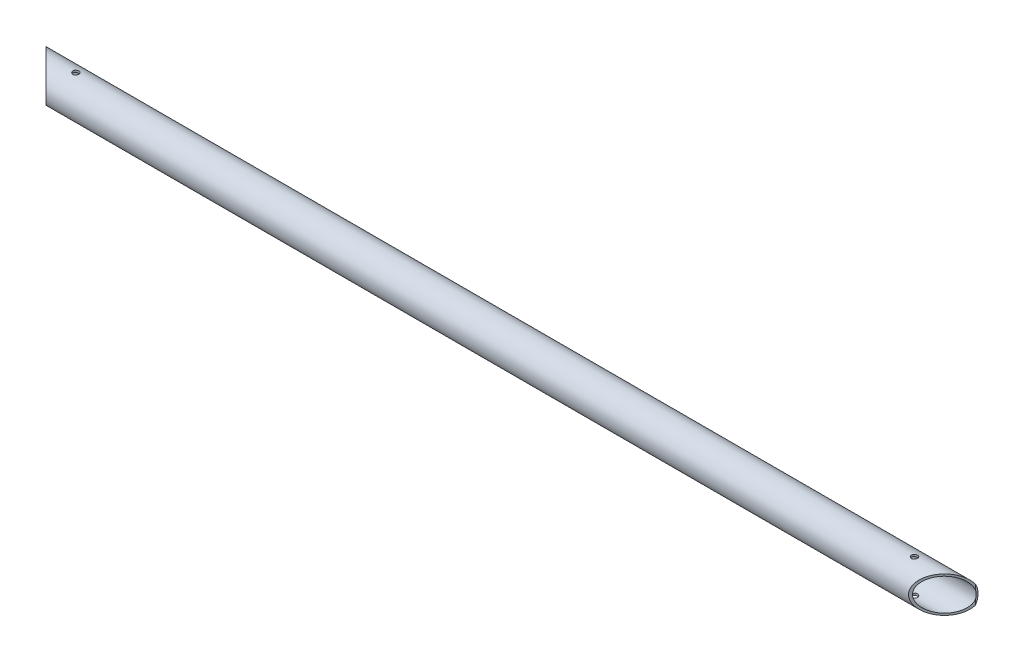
ISO-10303-21;
HEADER;
FILE_DESCRIPTION(('STEP AP214'),'2;1');
FILE_NAME('part.step','',(''),(''),'','','');
FILE_SCHEMA(('AUTOMOTIVE_DESIGN { 1 0 10303 214 1 1 1 1 }'));
ENDSEC;
DATA;
#1=APPLICATION_CONTEXT('core data for automotive mechanical design processes');
#2=APPLICATION_PROTOCOL_DEFINITION('international standard','automotive_design',2000,#1);
#3=PRODUCT_CONTEXT('',#1,'mechanical');
#4=PRODUCT('Part','Part','',(#3));
#5=PRODUCT_RELATED_PRODUCT_CATEGORY('part','',(#4));
#6=PRODUCT_DEFINITION_FORMATION('','',#4);
#7=PRODUCT_DEFINITION_CONTEXT('part definition',#1,'design');
#8=PRODUCT_DEFINITION('design','',#6,#7);
#9=PRODUCT_DEFINITION_SHAPE('','',#8);
#10=(LENGTH_UNIT() NAMED_UNIT(*) SI_UNIT(.MILLI.,.METRE.));
#11=(NAMED_UNIT(*) PLANE_ANGLE_UNIT() SI_UNIT($,.RADIAN.));
#12=(NAMED_UNIT(*) SI_UNIT($,.STERADIAN.) SOLID_ANGLE_UNIT());
#13=UNCERTAINTY_MEASURE_WITH_UNIT(LENGTH_MEASURE(1.E-05),#10,'distance_accuracy_value','');
#14=(GEOMETRIC_REPRESENTATION_CONTEXT(3) GLOBAL_UNCERTAINTY_ASSIGNED_CONTEXT((#13)) GLOBAL_UNIT_ASSIGNED_CONTEXT((#10,
#11,#12)) REPRESENTATION_CONTEXT('',''));
#15=CARTESIAN_POINT('',(0.,0.,0.));
#16=DIRECTION('',(0.,0.,1.));
#17=DIRECTION('',(1.,0.,0.));
#18=AXIS2_PLACEMENT_3D('',#15,#16,#17);
#19=CARTESIAN_POINT('',(495.3,0.,0.));
#20=DIRECTION('',(-1.,0.,0.));
#21=DIRECTION('',(0.,0.,1.));
#22=AXIS2_PLACEMENT_3D('',#19,#20,#21);
#23=CYLINDRICAL_SURFACE('',#22,19.05);
#24=CARTESIAN_POINT('',(-447.675,19.05,0.));
#25=CARTESIAN_POINT('',(-447.674992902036,19.0499969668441,-0.177026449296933));
#26=CARTESIAN_POINT('',(-447.660144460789,19.0475067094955,-0.354149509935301));
#27=CARTESIAN_POINT('',(-447.601167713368,19.0378123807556,-0.70342788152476));
#28=CARTESIAN_POINT('',(-447.557012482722,19.0306039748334,-0.875578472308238));
#29=CARTESIAN_POINT('',(-447.440792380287,19.0122818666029,-1.20980802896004));
#30=CARTESIAN_POINT('',(-447.368750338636,19.0011713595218,-1.37189510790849));
#31=CARTESIAN_POINT('',(-447.198861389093,18.9762666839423,-1.68166013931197));
#32=CARTESIAN_POINT('',(-447.101017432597,18.9624728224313,-1.8293397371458));
#33=CARTESIAN_POINT('',(-446.881307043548,18.9335831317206,-2.10753022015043));
#34=CARTESIAN_POINT('',(-446.759242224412,18.9184771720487,-2.23788338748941));
#35=CARTESIAN_POINT('',(-446.494982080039,18.8887433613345,-2.4763583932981));
#36=CARTESIAN_POINT('',(-446.35278548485,18.8741155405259,-2.58447882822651));
#37=CARTESIAN_POINT('',(-446.05121487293,18.8468960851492,-2.7760512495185));
#38=CARTESIAN_POINT('',(-445.891740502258,18.8343175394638,-2.85934728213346));
#39=CARTESIAN_POINT('',(-445.560818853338,18.8127613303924,-2.99790912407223));
#40=CARTESIAN_POINT('',(-445.389372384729,18.8037834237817,-3.0531768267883));
#41=CARTESIAN_POINT('',(-445.041045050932,18.790545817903,-3.13361625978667));
#42=CARTESIAN_POINT('',(-444.864228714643,18.7862434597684,-3.15906026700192));
#43=CARTESIAN_POINT('',(-444.508788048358,18.7827150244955,-3.1799742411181));
#44=CARTESIAN_POINT('',(-444.330163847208,18.7834885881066,-3.17544632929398));
#45=CARTESIAN_POINT('',(-443.97812161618,18.7899856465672,-3.13676677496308));
#46=CARTESIAN_POINT('',(-443.804668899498,18.7956580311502,-3.10292099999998));
#47=CARTESIAN_POINT('',(-443.465938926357,18.8112335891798,-3.00704648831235));
#48=CARTESIAN_POINT('',(-443.300661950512,18.8211369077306,-2.94501678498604));
#49=CARTESIAN_POINT('',(-442.98205939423,18.8441136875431,-2.79422510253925));
#50=CARTESIAN_POINT('',(-442.828795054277,18.857202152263,-2.70533611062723));
#51=CARTESIAN_POINT('',(-442.539241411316,18.8850640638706,-2.50343926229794));
#52=CARTESIAN_POINT('',(-442.402953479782,18.8998376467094,-2.39042945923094));
#53=CARTESIAN_POINT('',(-442.149450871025,18.9296297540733,-2.14183240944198));
#54=CARTESIAN_POINT('',(-442.032493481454,18.944649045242,-2.00598273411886));
#55=CARTESIAN_POINT('',(-441.822995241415,18.9730710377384,-1.71644976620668));
#56=CARTESIAN_POINT('',(-441.730454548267,18.9864737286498,-1.56276635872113));
#57=CARTESIAN_POINT('',(-441.572393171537,19.01017143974,-1.24168651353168));
#58=CARTESIAN_POINT('',(-441.506895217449,19.0204638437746,-1.07427868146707));
#59=CARTESIAN_POINT('',(-441.405017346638,19.0367602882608,-0.730628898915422));
#60=CARTESIAN_POINT('',(-441.368634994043,19.042764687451,-0.55438768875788));
#61=CARTESIAN_POINT('',(-441.326369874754,19.0497603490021,-0.200291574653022));
#62=CARTESIAN_POINT('',(-441.320133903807,19.0508096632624,-0.0224799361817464));
#63=CARTESIAN_POINT('',(-441.337396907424,19.0479359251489,0.331647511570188));
#64=CARTESIAN_POINT('',(-441.36089473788,19.0440130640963,0.507963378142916));
#65=CARTESIAN_POINT('',(-441.436664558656,19.0316717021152,0.853003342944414));
#66=CARTESIAN_POINT('',(-441.488761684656,19.0232805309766,1.02176690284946));
#67=CARTESIAN_POINT('',(-441.620064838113,19.0029396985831,1.34816454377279));
#68=CARTESIAN_POINT('',(-441.699272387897,18.9909898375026,1.50579799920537));
#69=CARTESIAN_POINT('',(-441.883356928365,18.9647133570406,1.8069949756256));
#70=CARTESIAN_POINT('',(-441.988454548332,18.9503666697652,1.95042186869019));
#71=CARTESIAN_POINT('',(-442.221032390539,18.9209485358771,2.21772935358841));
#72=CARTESIAN_POINT('',(-442.348514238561,18.9058770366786,2.34160852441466));
#73=CARTESIAN_POINT('',(-442.623825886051,18.8765202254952,2.56761333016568));
#74=CARTESIAN_POINT('',(-442.771852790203,18.8622446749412,2.66950032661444));
#75=CARTESIAN_POINT('',(-443.083128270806,18.8362784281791,2.84696193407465));
#76=CARTESIAN_POINT('',(-443.246376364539,18.8245876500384,2.92253737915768));
#77=CARTESIAN_POINT('',(-443.582792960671,18.8051878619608,3.04487368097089));
#78=CARTESIAN_POINT('',(-443.755917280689,18.7974624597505,3.09175331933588));
#79=CARTESIAN_POINT('',(-444.107722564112,18.7868270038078,3.15574102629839));
#80=CARTESIAN_POINT('',(-444.28640304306,18.7839165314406,3.17285168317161));
#81=CARTESIAN_POINT('',(-444.641865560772,18.783258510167,3.17674353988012));
#82=CARTESIAN_POINT('',(-444.818643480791,18.7854470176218,3.16390037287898));
#83=CARTESIAN_POINT('',(-445.167485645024,18.7946002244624,3.10906139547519));
#84=CARTESIAN_POINT('',(-445.339549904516,18.8015649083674,3.06706567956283));
#85=CARTESIAN_POINT('',(-445.673935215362,18.8194614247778,2.95525760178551));
#86=CARTESIAN_POINT('',(-445.836267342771,18.8303886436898,2.88547758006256));
#87=CARTESIAN_POINT('',(-446.146981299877,18.854983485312,2.72012029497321));
#88=CARTESIAN_POINT('',(-446.295362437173,18.8686512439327,2.62454175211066));
#89=CARTESIAN_POINT('',(-446.575860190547,18.8973898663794,2.40895998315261));
#90=CARTESIAN_POINT('',(-446.707762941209,18.912475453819,2.28868041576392));
#91=CARTESIAN_POINT('',(-446.949641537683,18.9422325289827,2.02769346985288));
#92=CARTESIAN_POINT('',(-447.059612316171,18.9569039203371,1.88698138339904));
#93=CARTESIAN_POINT('',(-447.255199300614,18.9842969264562,1.58796884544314));
#94=CARTESIAN_POINT('',(-447.340642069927,18.9970043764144,1.42955364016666));
#95=CARTESIAN_POINT('',(-447.483572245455,19.0188998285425,1.10047159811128));
#96=CARTESIAN_POINT('',(-447.541087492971,19.028091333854,0.92981715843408));
#97=CARTESIAN_POINT('',(-447.614046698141,19.0399135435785,0.63208320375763));
#98=CARTESIAN_POINT('',(-447.636867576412,19.0436757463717,0.506804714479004));
#99=CARTESIAN_POINT('',(-447.667346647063,19.0487200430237,0.254367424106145));
#100=CARTESIAN_POINT('',(-447.675005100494,19.0500021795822,0.127208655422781));
#101=CARTESIAN_POINT('',(-447.675,19.05,0.));
#102=B_SPLINE_CURVE_WITH_KNOTS('',3,(#24,#25,#26,#27,#28,#29,#30,#31,#32,#33,#34,#35,#36,#37,
#38,#39,#40,#41,#42,#43,#44,#45,#46,#47,#48,#49,#50,#51,#52,#53,#54,#55,#56,#57,#58,#59,#60,#61,
#62,#63,#64,#65,#66,#67,#68,#69,#70,#71,#72,#73,#74,#75,#76,#77,#78,#79,#80,#81,#82,#83,#84,#85,
#86,#87,#88,#89,#90,#91,#92,#93,#94,#95,#96,#97,#98,#99,#100,#101),.UNSPECIFIED.,.T.,.F.,(4,2,2,
2,2,2,2,2,2,2,2,2,2,2,2,2,2,2,2,2,2,2,2,2,2,2,2,2,2,2,2,2,2,2,2,2,2,2,4),(0.,0.530614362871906,
1.06171688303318,1.59238552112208,2.12299348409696,2.65814163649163,3.19332356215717,
3.73180001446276,4.27024008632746,4.80372517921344,5.33717251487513,5.86512062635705,
6.39308684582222,6.92358986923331,7.45413572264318,7.9912561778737,8.52838009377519,
9.0659545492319,9.60348402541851,10.1347001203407,10.6658957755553,11.1938791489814,
11.7218921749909,12.2545706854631,12.7872879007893,13.3255235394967,13.8637421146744,
14.3997174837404,14.9356462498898,15.4648904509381,15.9941329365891,16.5227611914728,
17.0514156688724,17.5863425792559,18.1213929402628,18.6601383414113,19.1983455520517,
19.5796439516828,19.9609357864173),.UNSPECIFIED.);
#103=CARTESIAN_POINT('',(-447.675,19.05,0.));
#104=VERTEX_POINT('',#103);
#105=EDGE_CURVE('E164',#104,#104,#102,.T.);
#106=ORIENTED_EDGE('',*,*,#105,.T.);
#107=EDGE_LOOP('',(#106));
#108=FACE_BOUND('',#107,.T.);
#109=CARTESIAN_POINT('',(-444.5,-18.7835533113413,-3.17499999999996));
#110=CARTESIAN_POINT('',(-444.677007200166,-18.7835565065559,-3.17499288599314));
#111=CARTESIAN_POINT('',(-444.854111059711,-18.7860824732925,-3.16014756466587));
#112=CARTESIAN_POINT('',(-445.203349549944,-18.7959042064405,-3.10118433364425));
#113=CARTESIAN_POINT('',(-445.375479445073,-18.8032043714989,-3.05703942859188));
#114=CARTESIAN_POINT('',(-445.709665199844,-18.8217252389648,-2.94084952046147));
#115=CARTESIAN_POINT('',(-445.871729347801,-18.8329426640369,-2.86882783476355));
#116=CARTESIAN_POINT('',(-446.181455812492,-18.858030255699,-2.69898685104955));
#117=CARTESIAN_POINT('',(-446.329119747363,-18.8719001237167,-2.60117045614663));
#118=CARTESIAN_POINT('',(-446.607327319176,-18.9008825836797,-2.38148815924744));
#119=CARTESIAN_POINT('',(-446.737708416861,-18.9160050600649,-2.25941769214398));
#120=CARTESIAN_POINT('',(-446.976237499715,-18.945701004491,-1.9951344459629));
#121=CARTESIAN_POINT('',(-447.084384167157,-18.960274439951,-1.85292047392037));
#122=CARTESIAN_POINT('',(-447.275984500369,-18.9873348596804,-1.55133404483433));
#123=CARTESIAN_POINT('',(-447.359286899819,-18.9998088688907,-1.39186422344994));
#124=CARTESIAN_POINT('',(-447.497861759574,-19.0211549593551,-1.06095243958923));
#125=CARTESIAN_POINT('',(-447.553136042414,-19.0300272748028,-0.889511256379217));
#126=CARTESIAN_POINT('',(-447.63358851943,-19.0431005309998,-0.54120253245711));
#127=CARTESIAN_POINT('',(-447.659039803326,-19.0473438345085,-0.364399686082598));
#128=CARTESIAN_POINT('',(-447.679973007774,-19.0508265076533,-0.00898561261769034));
#129=CARTESIAN_POINT('',(-447.675456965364,-19.0500662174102,0.169625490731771));
#130=CARTESIAN_POINT('',(-447.636796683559,-19.0436609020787,0.521718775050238));
#131=CARTESIAN_POINT('',(-447.60294634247,-19.0380643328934,0.695234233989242));
#132=CARTESIAN_POINT('',(-447.507041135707,-19.0226693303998,1.03408731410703));
#133=CARTESIAN_POINT('',(-447.444985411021,-19.0128707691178,1.19942468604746));
#134=CARTESIAN_POINT('',(-447.2941388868,-18.9900902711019,1.518102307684));
#135=CARTESIAN_POINT('',(-447.205226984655,-18.9770939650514,1.67138416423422));
#136=CARTESIAN_POINT('',(-447.003280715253,-18.949361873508,1.96096322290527));
#137=CARTESIAN_POINT('',(-446.890244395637,-18.934625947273,2.09725904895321));
#138=CARTESIAN_POINT('',(-446.641627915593,-18.904842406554,2.35073351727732));
#139=CARTESIAN_POINT('',(-446.505790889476,-18.8897931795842,2.46766016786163));
#140=CARTESIAN_POINT('',(-446.216294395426,-18.861252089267,2.67710232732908));
#141=CARTESIAN_POINT('',(-446.062634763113,-18.8477602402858,2.76961761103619));
#142=CARTESIAN_POINT('',(-445.741562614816,-18.8238606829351,2.92766043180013));
#143=CARTESIAN_POINT('',(-445.574134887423,-18.813456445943,2.99315762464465));
#144=CARTESIAN_POINT('',(-445.230441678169,-18.7969675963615,3.09502793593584));
#145=CARTESIAN_POINT('',(-445.054176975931,-18.7908826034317,3.1314036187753));
#146=CARTESIAN_POINT('',(-444.700067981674,-18.7837947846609,3.17364349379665));
#147=CARTESIAN_POINT('',(-444.522267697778,-18.7827321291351,3.17986690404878));
#148=CARTESIAN_POINT('',(-444.168165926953,-18.785649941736,3.16258283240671));
#149=CARTESIAN_POINT('',(-443.991864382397,-18.7896302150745,3.13907649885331));
#150=CARTESIAN_POINT('',(-443.646905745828,-18.8021301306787,3.06330646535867));
#151=CARTESIAN_POINT('',(-443.478207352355,-18.810620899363,3.01122561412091));
#152=CARTESIAN_POINT('',(-443.151932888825,-18.8311608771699,2.87997670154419));
#153=CARTESIAN_POINT('',(-442.99435748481,-18.8432102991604,2.80080701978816));
#154=CARTESIAN_POINT('',(-442.693203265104,-18.8696489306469,2.61677997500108));
#155=CARTESIAN_POINT('',(-442.5497669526,-18.8840586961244,2.51169241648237));
#156=CARTESIAN_POINT('',(-442.282435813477,-18.9135342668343,2.27912862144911));
#157=CARTESIAN_POINT('',(-442.158542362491,-18.9286001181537,2.1516508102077));
#158=CARTESIAN_POINT('',(-441.932502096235,-18.957879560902,1.87633364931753));
#159=CARTESIAN_POINT('',(-441.830594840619,-18.9720826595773,1.7282963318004));
#160=CARTESIAN_POINT('',(-441.653097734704,-18.9978679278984,1.41699417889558));
#161=CARTESIAN_POINT('',(-441.577507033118,-19.0094501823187,1.25372983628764));
#162=CARTESIAN_POINT('',(-441.455161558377,-19.0286431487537,0.917319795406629));
#163=CARTESIAN_POINT('',(-441.408281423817,-19.0362711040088,0.744220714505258));
#164=CARTESIAN_POINT('',(-441.344284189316,-19.0467689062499,0.392469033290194));
#165=CARTESIAN_POINT('',(-441.32716464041,-19.0496391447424,0.213816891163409));
#166=CARTESIAN_POINT('',(-441.323245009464,-19.0502925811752,-0.141657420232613));
#167=CARTESIAN_POINT('',(-441.336080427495,-19.0481369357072,-0.318475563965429));
#168=CARTESIAN_POINT('',(-441.390917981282,-19.0391056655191,-0.667400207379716));
#169=CARTESIAN_POINT('',(-441.432919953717,-19.0322300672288,-0.839506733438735));
#170=CARTESIAN_POINT('',(-441.54475847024,-19.014528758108,-1.17398348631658));
#171=CARTESIAN_POINT('',(-441.614564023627,-19.0037074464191,-1.33636432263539));
#172=CARTESIAN_POINT('',(-441.779987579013,-18.979296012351,-1.64716517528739));
#173=CARTESIAN_POINT('',(-441.875606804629,-18.9657057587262,-1.79558452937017));
#174=CARTESIAN_POINT('',(-442.091235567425,-18.9370668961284,-2.07608544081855));
#175=CARTESIAN_POINT('',(-442.211512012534,-18.9220033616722,-2.20796031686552));
#176=CARTESIAN_POINT('',(-442.472480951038,-18.8922190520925,-2.44978412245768));
#177=CARTESIAN_POINT('',(-442.613178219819,-18.8774983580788,-2.55972790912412));
#178=CARTESIAN_POINT('',(-442.912176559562,-18.8499539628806,-2.75528312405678));
#179=CARTESIAN_POINT('',(-443.070595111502,-18.8371444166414,-2.84071693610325));
#180=CARTESIAN_POINT('',(-443.399683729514,-18.8150399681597,-2.98362946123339));
#181=CARTESIAN_POINT('',(-443.5703413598,-18.805741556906,-3.04113610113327));
#182=CARTESIAN_POINT('',(-443.868052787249,-18.7937742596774,-3.11407308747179));
#183=CARTESIAN_POINT('',(-443.993304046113,-18.7899627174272,-3.13688402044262));
#184=CARTESIAN_POINT('',(-444.245686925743,-18.7848511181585,-3.16734989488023));
#185=CARTESIAN_POINT('',(-444.372818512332,-18.7835510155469,-3.17500511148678));
#186=CARTESIAN_POINT('',(-444.5,-18.7835533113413,-3.17499999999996));
#187=B_SPLINE_CURVE_WITH_KNOTS('',3,(#109,#110,#111,#112,#113,#114,#115,#116,#117,#118,#119,
#120,#121,#122,#123,#124,#125,#126,#127,#128,#129,#130,#131,#132,#133,#134,#135,#136,#137,#138,
#139,#140,#141,#142,#143,#144,#145,#146,#147,#148,#149,#150,#151,#152,#153,#154,#155,#156,#157,
#158,#159,#160,#161,#162,#163,#164,#165,#166,#167,#168,#169,#170,#171,#172,#173,#174,#175,#176,
#177,#178,#179,#180,#181,#182,#183,#184,#185,#186),.UNSPECIFIED.,.T.,.F.,(4,2,2,2,2,2,2,2,2,2,2,
2,2,2,2,2,2,2,2,2,2,2,2,2,2,2,2,2,2,2,2,2,2,2,2,2,2,2,4),(0.,0.530556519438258,1.061602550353,
1.59220534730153,2.12274845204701,2.65797232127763,3.19322790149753,3.73167884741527,
4.27009477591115,4.80354090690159,5.3369507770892,5.86507743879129,6.39322018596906,
6.92378097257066,7.45438471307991,7.99142576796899,8.52847177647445,9.06611931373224,
9.60371950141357,10.1348989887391,10.6660579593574,11.1938570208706,11.7216876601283,
12.2543867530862,12.7871233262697,13.3254002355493,13.863659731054,14.399551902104,
14.9353999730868,15.4647617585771,15.994120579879,16.5228910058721,17.0516865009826,
17.5865408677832,18.121520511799,18.6602843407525,19.1985082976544,19.5797255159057,
19.9609358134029),.UNSPECIFIED.);
#188=CARTESIAN_POINT('',(-444.5,-18.7835533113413,-3.17499999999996));
#189=VERTEX_POINT('',#188);
#190=EDGE_CURVE('E160',#189,#189,#187,.T.);
#191=ORIENTED_EDGE('',*,*,#190,.T.);
#192=EDGE_LOOP('',(#191));
#193=FACE_BOUND('',#192,.T.);
#194=CARTESIAN_POINT('',(476.25,0.,0.));
#195=DIRECTION('',(-0.707106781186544,0.,-0.707106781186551));
#196=DIRECTION('',(-0.707106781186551,0.,0.707106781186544));
#197=AXIS2_PLACEMENT_3D('',#194,#195,#196);
#198=ELLIPSE('',#197,26.9407683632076,19.05);
#199=CARTESIAN_POINT('',(492.76,-9.50380976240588,-16.5100000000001));
#200=VERTEX_POINT('',#199);
#201=CARTESIAN_POINT('',(492.76,9.50380976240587,-16.51));
#202=VERTEX_POINT('',#201);
#203=EDGE_CURVE('E78',#200,#202,#198,.T.);
#204=ORIENTED_EDGE('',*,*,#203,.T.);
#205=CARTESIAN_POINT('',(492.76,0.,0.));
#206=DIRECTION('',(-1.,0.,0.));
#207=DIRECTION('',(0.,0.,1.));
#208=AXIS2_PLACEMENT_3D('',#205,#206,#207);
#209=CIRCLE('',#208,19.05);
#210=EDGE_CURVE('E51',#202,#200,#209,.T.);
#211=ORIENTED_EDGE('',*,*,#210,.T.);
#212=EDGE_LOOP('',(#204,#211));
#213=FACE_BOUND('',#212,.T.);
#214=CARTESIAN_POINT('',(-492.76,0.,0.));
#215=DIRECTION('',(-1.,0.,0.));
#216=DIRECTION('',(0.,0.,1.));
#217=AXIS2_PLACEMENT_3D('',#214,#215,#216);
#218=CIRCLE('',#217,19.05);
#219=CARTESIAN_POINT('',(-492.76,9.50380976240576,-16.5100000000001));
#220=VERTEX_POINT('',#219);
#221=CARTESIAN_POINT('',(-492.76,-9.50380976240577,-16.51));
#222=VERTEX_POINT('',#221);
#223=EDGE_CURVE('E59',#220,#222,#218,.T.);
#224=ORIENTED_EDGE('',*,*,#223,.F.);
#225=CARTESIAN_POINT('',(-476.25,0.,0.));
#226=DIRECTION('',(-0.707106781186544,0.,0.707106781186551));
#227=DIRECTION('',(-0.707106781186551,0.,-0.707106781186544));
#228=AXIS2_PLACEMENT_3D('',#225,#226,#227);
#229=ELLIPSE('',#228,26.9407683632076,19.05);
#230=EDGE_CURVE('E92',#222,#220,#229,.T.);
#231=ORIENTED_EDGE('',*,*,#230,.F.);
#232=EDGE_LOOP('',(#224,#231));
#233=FACE_BOUND('',#232,.T.);
#234=CARTESIAN_POINT('',(444.5,-18.7835533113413,-3.17499999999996));
#235=CARTESIAN_POINT('',(444.677007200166,-18.7835565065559,-3.17499288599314));
#236=CARTESIAN_POINT('',(444.854111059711,-18.7860824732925,-3.16014756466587));
#237=CARTESIAN_POINT('',(445.203349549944,-18.7959042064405,-3.10118433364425));
#238=CARTESIAN_POINT('',(445.375479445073,-18.8032043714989,-3.05703942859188));
#239=CARTESIAN_POINT('',(445.709665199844,-18.8217252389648,-2.94084952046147));
#240=CARTESIAN_POINT('',(445.871729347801,-18.8329426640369,-2.86882783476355));
#241=CARTESIAN_POINT('',(446.181455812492,-18.858030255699,-2.69898685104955));
#242=CARTESIAN_POINT('',(446.329119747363,-18.8719001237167,-2.60117045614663));
#243=CARTESIAN_POINT('',(446.607327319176,-18.9008825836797,-2.38148815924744));
#244=CARTESIAN_POINT('',(446.737708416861,-18.9160050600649,-2.25941769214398));
#245=CARTESIAN_POINT('',(446.976237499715,-18.945701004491,-1.9951344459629));
#246=CARTESIAN_POINT('',(447.084384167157,-18.960274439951,-1.85292047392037));
#247=CARTESIAN_POINT('',(447.275984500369,-18.9873348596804,-1.55133404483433));
#248=CARTESIAN_POINT('',(447.359286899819,-18.9998088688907,-1.39186422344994));
#249=CARTESIAN_POINT('',(447.497861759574,-19.0211549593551,-1.06095243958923));
#250=CARTESIAN_POINT('',(447.553136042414,-19.0300272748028,-0.889511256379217));
#251=CARTESIAN_POINT('',(447.63358851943,-19.0431005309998,-0.54120253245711));
#252=CARTESIAN_POINT('',(447.659039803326,-19.0473438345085,-0.364399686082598));
#253=CARTESIAN_POINT('',(447.679973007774,-19.0508265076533,-0.00898561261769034));
#254=CARTESIAN_POINT('',(447.675456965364,-19.0500662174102,0.169625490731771));
#255=CARTESIAN_POINT('',(447.636796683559,-19.0436609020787,0.521718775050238));
#256=CARTESIAN_POINT('',(447.60294634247,-19.0380643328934,0.695234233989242));
#257=CARTESIAN_POINT('',(447.507041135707,-19.0226693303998,1.03408731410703));
#258=CARTESIAN_POINT('',(447.444985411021,-19.0128707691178,1.19942468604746));
#259=CARTESIAN_POINT('',(447.2941388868,-18.9900902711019,1.518102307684));
#260=CARTESIAN_POINT('',(447.205226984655,-18.9770939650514,1.67138416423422));
#261=CARTESIAN_POINT('',(447.003280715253,-18.949361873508,1.96096322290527));
#262=CARTESIAN_POINT('',(446.890244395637,-18.934625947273,2.09725904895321));
#263=CARTESIAN_POINT('',(446.641627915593,-18.904842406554,2.35073351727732));
#264=CARTESIAN_POINT('',(446.505790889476,-18.8897931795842,2.46766016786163));
#265=CARTESIAN_POINT('',(446.216294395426,-18.861252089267,2.67710232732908));
#266=CARTESIAN_POINT('',(446.062634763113,-18.8477602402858,2.76961761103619));
#267=CARTESIAN_POINT('',(445.741562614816,-18.8238606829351,2.92766043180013));
#268=CARTESIAN_POINT('',(445.574134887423,-18.813456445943,2.99315762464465));
#269=CARTESIAN_POINT('',(445.230441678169,-18.7969675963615,3.09502793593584));
#270=CARTESIAN_POINT('',(445.054176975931,-18.7908826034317,3.1314036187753));
#271=CARTESIAN_POINT('',(444.700067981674,-18.7837947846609,3.17364349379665));
#272=CARTESIAN_POINT('',(444.522267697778,-18.7827321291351,3.17986690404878));
#273=CARTESIAN_POINT('',(444.168165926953,-18.785649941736,3.16258283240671));
#274=CARTESIAN_POINT('',(443.991864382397,-18.7896302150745,3.13907649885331));
#275=CARTESIAN_POINT('',(443.646905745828,-18.8021301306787,3.06330646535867));
#276=CARTESIAN_POINT('',(443.478207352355,-18.810620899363,3.01122561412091));
#277=CARTESIAN_POINT('',(443.151932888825,-18.8311608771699,2.87997670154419));
#278=CARTESIAN_POINT('',(442.99435748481,-18.8432102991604,2.80080701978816));
#279=CARTESIAN_POINT('',(442.693203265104,-18.8696489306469,2.61677997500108));
#280=CARTESIAN_POINT('',(442.5497669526,-18.8840586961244,2.51169241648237));
#281=CARTESIAN_POINT('',(442.282435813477,-18.9135342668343,2.27912862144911));
#282=CARTESIAN_POINT('',(442.158542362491,-18.9286001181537,2.1516508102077));
#283=CARTESIAN_POINT('',(441.932502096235,-18.957879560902,1.87633364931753));
#284=CARTESIAN_POINT('',(441.830594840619,-18.9720826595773,1.7282963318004));
#285=CARTESIAN_POINT('',(441.653097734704,-18.9978679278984,1.41699417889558));
#286=CARTESIAN_POINT('',(441.577507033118,-19.0094501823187,1.25372983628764));
#287=CARTESIAN_POINT('',(441.455161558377,-19.0286431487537,0.917319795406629));
#288=CARTESIAN_POINT('',(441.408281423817,-19.0362711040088,0.744220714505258));
#289=CARTESIAN_POINT('',(441.344284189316,-19.0467689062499,0.392469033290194));
#290=CARTESIAN_POINT('',(441.32716464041,-19.0496391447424,0.213816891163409));
#291=CARTESIAN_POINT('',(441.323245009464,-19.0502925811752,-0.141657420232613));
#292=CARTESIAN_POINT('',(441.336080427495,-19.0481369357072,-0.318475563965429));
#293=CARTESIAN_POINT('',(441.390917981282,-19.0391056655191,-0.667400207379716));
#294=CARTESIAN_POINT('',(441.432919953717,-19.0322300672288,-0.839506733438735));
#295=CARTESIAN_POINT('',(441.54475847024,-19.014528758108,-1.17398348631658));
#296=CARTESIAN_POINT('',(441.614564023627,-19.0037074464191,-1.33636432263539));
#297=CARTESIAN_POINT('',(441.779987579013,-18.979296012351,-1.64716517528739));
#298=CARTESIAN_POINT('',(441.875606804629,-18.9657057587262,-1.79558452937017));
#299=CARTESIAN_POINT('',(442.091235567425,-18.9370668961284,-2.07608544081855));
#300=CARTESIAN_POINT('',(442.211512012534,-18.9220033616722,-2.20796031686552));
#301=CARTESIAN_POINT('',(442.472480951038,-18.8922190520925,-2.44978412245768));
#302=CARTESIAN_POINT('',(442.613178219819,-18.8774983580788,-2.55972790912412));
#303=CARTESIAN_POINT('',(442.912176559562,-18.8499539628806,-2.75528312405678));
#304=CARTESIAN_POINT('',(443.070595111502,-18.8371444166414,-2.84071693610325));
#305=CARTESIAN_POINT('',(443.399683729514,-18.8150399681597,-2.98362946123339));
#306=CARTESIAN_POINT('',(443.5703413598,-18.805741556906,-3.04113610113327));
#307=CARTESIAN_POINT('',(443.868052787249,-18.7937742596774,-3.11407308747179));
#308=CARTESIAN_POINT('',(443.993304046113,-18.7899627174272,-3.13688402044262));
#309=CARTESIAN_POINT('',(444.245686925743,-18.7848511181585,-3.16734989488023));
#310=CARTESIAN_POINT('',(444.372818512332,-18.7835510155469,-3.17500511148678));
#311=CARTESIAN_POINT('',(444.5,-18.7835533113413,-3.17499999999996));
#312=B_SPLINE_CURVE_WITH_KNOTS('',3,(#234,#235,#236,#237,#238,#239,#240,#241,#242,#243,#244,
#245,#246,#247,#248,#249,#250,#251,#252,#253,#254,#255,#256,#257,#258,#259,#260,#261,#262,#263,
#264,#265,#266,#267,#268,#269,#270,#271,#272,#273,#274,#275,#276,#277,#278,#279,#280,#281,#282,
#283,#284,#285,#286,#287,#288,#289,#290,#291,#292,#293,#294,#295,#296,#297,#298,#299,#300,#301,
#302,#303,#304,#305,#306,#307,#308,#309,#310,#311),.UNSPECIFIED.,.T.,.F.,(4,2,2,2,2,2,2,2,2,2,2,
2,2,2,2,2,2,2,2,2,2,2,2,2,2,2,2,2,2,2,2,2,2,2,2,2,2,2,4),(0.,0.530556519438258,1.061602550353,
1.59220534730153,2.12274845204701,2.65797232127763,3.19322790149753,3.73167884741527,
4.27009477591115,4.80354090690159,5.3369507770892,5.86507743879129,6.39322018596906,
6.92378097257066,7.45438471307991,7.99142576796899,8.52847177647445,9.06611931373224,
9.60371950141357,10.1348989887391,10.6660579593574,11.1938570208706,11.7216876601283,
12.2543867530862,12.7871233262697,13.3254002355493,13.863659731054,14.399551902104,
14.9353999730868,15.4647617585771,15.994120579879,16.5228910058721,17.0516865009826,
17.5865408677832,18.121520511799,18.6602843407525,19.1985082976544,19.5797255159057,
19.9609358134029),.UNSPECIFIED.);
#313=CARTESIAN_POINT('',(444.5,-18.7835533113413,-3.17499999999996));
#314=VERTEX_POINT('',#313);
#315=EDGE_CURVE('E127',#314,#314,#312,.T.);
#316=ORIENTED_EDGE('',*,*,#315,.F.);
#317=EDGE_LOOP('',(#316));
#318=FACE_BOUND('',#317,.T.);
#319=CARTESIAN_POINT('',(441.325,19.05,0.));
#320=CARTESIAN_POINT('',(441.325007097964,19.0499969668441,0.177026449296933));
#321=CARTESIAN_POINT('',(441.339855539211,19.0475067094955,0.354149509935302));
#322=CARTESIAN_POINT('',(441.398832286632,19.0378123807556,0.703427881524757));
#323=CARTESIAN_POINT('',(441.442987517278,19.0306039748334,0.875578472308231));
#324=CARTESIAN_POINT('',(441.559207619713,19.0122818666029,1.20980802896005));
#325=CARTESIAN_POINT('',(441.631249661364,19.0011713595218,1.37189510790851));
#326=CARTESIAN_POINT('',(441.801138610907,18.9762666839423,1.68166013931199));
#327=CARTESIAN_POINT('',(441.898982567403,18.9624728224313,1.82933973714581));
#328=CARTESIAN_POINT('',(442.118692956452,18.9335831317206,2.10753022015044));
#329=CARTESIAN_POINT('',(442.240757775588,18.9184771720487,2.23788338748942));
#330=CARTESIAN_POINT('',(442.505017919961,18.8887433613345,2.47635839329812));
#331=CARTESIAN_POINT('',(442.64721451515,18.8741155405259,2.58447882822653));
#332=CARTESIAN_POINT('',(442.94878512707,18.8468960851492,2.77605124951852));
#333=CARTESIAN_POINT('',(443.108259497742,18.8343175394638,2.85934728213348));
#334=CARTESIAN_POINT('',(443.439181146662,18.8127613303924,2.99790912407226));
#335=CARTESIAN_POINT('',(443.610627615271,18.8037834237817,3.05317682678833));
#336=CARTESIAN_POINT('',(443.958954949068,18.790545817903,3.13361625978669));
#337=CARTESIAN_POINT('',(444.135771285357,18.7862434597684,3.15906026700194));
#338=CARTESIAN_POINT('',(444.491211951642,18.7827150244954,3.17997424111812));
#339=CARTESIAN_POINT('',(444.669836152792,18.7834885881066,3.17544632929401));
#340=CARTESIAN_POINT('',(445.02187838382,18.7899856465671,3.1367667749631));
#341=CARTESIAN_POINT('',(445.195331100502,18.7956580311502,3.102921));
#342=CARTESIAN_POINT('',(445.534061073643,18.8112335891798,3.00704648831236));
#343=CARTESIAN_POINT('',(445.699338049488,18.8211369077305,2.94501678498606));
#344=CARTESIAN_POINT('',(446.01794060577,18.8441136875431,2.79422510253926));
#345=CARTESIAN_POINT('',(446.171204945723,18.857202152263,2.70533611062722));
#346=CARTESIAN_POINT('',(446.460758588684,18.8850640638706,2.50343926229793));
#347=CARTESIAN_POINT('',(446.597046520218,18.8998376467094,2.39042945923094));
#348=CARTESIAN_POINT('',(446.850549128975,18.9296297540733,2.14183240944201));
#349=CARTESIAN_POINT('',(446.967506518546,18.944649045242,2.0059827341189));
#350=CARTESIAN_POINT('',(447.177004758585,18.9730710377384,1.71644976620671));
#351=CARTESIAN_POINT('',(447.269545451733,18.9864737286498,1.56276635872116));
#352=CARTESIAN_POINT('',(447.427606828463,19.01017143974,1.24168651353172));
#353=CARTESIAN_POINT('',(447.493104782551,19.0204638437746,1.07427868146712));
#354=CARTESIAN_POINT('',(447.594982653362,19.0367602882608,0.73062889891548));
#355=CARTESIAN_POINT('',(447.631365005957,19.042764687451,0.554387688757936));
#356=CARTESIAN_POINT('',(447.673630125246,19.0497603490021,0.200291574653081));
#357=CARTESIAN_POINT('',(447.679866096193,19.0508096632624,0.0224799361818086));
#358=CARTESIAN_POINT('',(447.662603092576,19.0479359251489,-0.331647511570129));
#359=CARTESIAN_POINT('',(447.63910526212,19.0440130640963,-0.507963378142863));
#360=CARTESIAN_POINT('',(447.563335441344,19.0316717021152,-0.853003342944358));
#361=CARTESIAN_POINT('',(447.511238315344,19.0232805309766,-1.02176690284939));
#362=CARTESIAN_POINT('',(447.379935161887,19.0029396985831,-1.34816454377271));
#363=CARTESIAN_POINT('',(447.300727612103,18.9909898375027,-1.5057979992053));
#364=CARTESIAN_POINT('',(447.116643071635,18.9647133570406,-1.80699497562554));
#365=CARTESIAN_POINT('',(447.011545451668,18.9503666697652,-1.95042186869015));
#366=CARTESIAN_POINT('',(446.778967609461,18.9209485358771,-2.21772935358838));
#367=CARTESIAN_POINT('',(446.651485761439,18.9058770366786,-2.34160852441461));
#368=CARTESIAN_POINT('',(446.376174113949,18.8765202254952,-2.56761333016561));
#369=CARTESIAN_POINT('',(446.228147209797,18.8622446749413,-2.66950032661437));
#370=CARTESIAN_POINT('',(445.916871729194,18.8362784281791,-2.84696193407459));
#371=CARTESIAN_POINT('',(445.753623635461,18.8245876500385,-2.92253737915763));
#372=CARTESIAN_POINT('',(445.417207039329,18.8051878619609,-3.04487368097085));
#373=CARTESIAN_POINT('',(445.244082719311,18.7974624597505,-3.09175331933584));
#374=CARTESIAN_POINT('',(444.892277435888,18.7868270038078,-3.15574102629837));
#375=CARTESIAN_POINT('',(444.71359695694,18.7839165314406,-3.17285168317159));
#376=CARTESIAN_POINT('',(444.358134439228,18.783258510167,-3.1767435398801));
#377=CARTESIAN_POINT('',(444.181356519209,18.7854470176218,-3.16390037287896));
#378=CARTESIAN_POINT('',(443.832514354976,18.7946002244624,-3.10906139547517));
#379=CARTESIAN_POINT('',(443.660450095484,18.8015649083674,-3.06706567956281));
#380=CARTESIAN_POINT('',(443.326064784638,18.8194614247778,-2.95525760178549));
#381=CARTESIAN_POINT('',(443.163732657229,18.8303886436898,-2.88547758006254));
#382=CARTESIAN_POINT('',(442.853018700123,18.854983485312,-2.72012029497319));
#383=CARTESIAN_POINT('',(442.704637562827,18.8686512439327,-2.62454175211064));
#384=CARTESIAN_POINT('',(442.424139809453,18.8973898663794,-2.40895998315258));
#385=CARTESIAN_POINT('',(442.292237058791,18.9124754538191,-2.28868041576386));
#386=CARTESIAN_POINT('',(442.050358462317,18.9422325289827,-2.02769346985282));
#387=CARTESIAN_POINT('',(441.94038768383,18.9569039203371,-1.886981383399));
#388=CARTESIAN_POINT('',(441.744800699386,18.9842969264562,-1.58796884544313));
#389=CARTESIAN_POINT('',(441.659357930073,18.9970043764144,-1.42955364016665));
#390=CARTESIAN_POINT('',(441.516427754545,19.0188998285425,-1.10047159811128));
#391=CARTESIAN_POINT('',(441.458912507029,19.028091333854,-0.929817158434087));
#392=CARTESIAN_POINT('',(441.385953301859,19.0399135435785,-0.632083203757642));
#393=CARTESIAN_POINT('',(441.363132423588,19.0436757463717,-0.506804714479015));
#394=CARTESIAN_POINT('',(441.332653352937,19.0487200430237,-0.25436742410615));
#395=CARTESIAN_POINT('',(441.324994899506,19.0500021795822,-0.127208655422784));
#396=CARTESIAN_POINT('',(441.325,19.05,0.));
#397=B_SPLINE_CURVE_WITH_KNOTS('',3,(#319,#320,#321,#322,#323,#324,#325,#326,#327,#328,#329,
#330,#331,#332,#333,#334,#335,#336,#337,#338,#339,#340,#341,#342,#343,#344,#345,#346,#347,#348,
#349,#350,#351,#352,#353,#354,#355,#356,#357,#358,#359,#360,#361,#362,#363,#364,#365,#366,#367,
#368,#369,#370,#371,#372,#373,#374,#375,#376,#377,#378,#379,#380,#381,#382,#383,#384,#385,#386,
#387,#388,#389,#390,#391,#392,#393,#394,#395,#396),.UNSPECIFIED.,.T.,.F.,(4,2,2,2,2,2,2,2,2,2,2,
2,2,2,2,2,2,2,2,2,2,2,2,2,2,2,2,2,2,2,2,2,2,2,2,2,2,2,4),(0.,0.530614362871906,1.06171688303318,
1.59238552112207,2.12299348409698,2.65814163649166,3.1933235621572,3.73180001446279,
4.27024008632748,4.80372517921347,5.33717251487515,5.86512062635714,6.39308684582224,
6.92358986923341,7.4541357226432,7.99125617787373,8.52838009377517,9.06595454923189,
9.60348402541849,10.1347001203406,10.6658957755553,11.1938791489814,11.7218921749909,
12.2545706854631,12.7872879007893,13.3255235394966,13.8637421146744,14.3997174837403,
14.9356462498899,15.4648904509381,15.9941329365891,16.5227611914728,17.0514156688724,
17.586342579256,18.1213929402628,18.6601383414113,19.1983455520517,19.5796439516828,
19.9609357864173),.UNSPECIFIED.);
#398=CARTESIAN_POINT('',(441.325,19.05,0.));
#399=VERTEX_POINT('',#398);
#400=EDGE_CURVE('E131',#399,#399,#397,.T.);
#401=ORIENTED_EDGE('',*,*,#400,.F.);
#402=EDGE_LOOP('',(#401));
#403=FACE_BOUND('',#402,.T.);
#404=ADVANCED_FACE('F31',(#108,#193,#213,#233,#318,#403),#23,.T.);
#405=CARTESIAN_POINT('',(495.3,0.,0.));
#406=DIRECTION('',(-1.,0.,0.));
#407=DIRECTION('',(0.,0.,1.));
#408=AXIS2_PLACEMENT_3D('',#405,#406,#407);
#409=CYLINDRICAL_SURFACE('',#408,16.9418);
#410=CARTESIAN_POINT('',(-444.5,16.641633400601,-3.17499999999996));
#411=CARTESIAN_POINT('',(-444.323347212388,16.6416368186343,-3.17499322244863));
#412=CARTESIAN_POINT('',(-444.146606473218,16.6444767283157,-3.16020689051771));
#413=CARTESIAN_POINT('',(-443.798108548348,16.6555153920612,-3.10149205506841));
#414=CARTESIAN_POINT('',(-443.626355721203,16.6637186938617,-3.05753881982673));
#415=CARTESIAN_POINT('',(-443.292926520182,16.6845231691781,-2.94188729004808));
#416=CARTESIAN_POINT('',(-443.131240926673,16.6971202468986,-2.87021482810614));
#417=CARTESIAN_POINT('',(-442.822199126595,16.725288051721,-2.7012277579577));
#418=CARTESIAN_POINT('',(-442.674841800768,16.7408585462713,-2.60391515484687));
#419=CARTESIAN_POINT('',(-442.396796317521,16.7734350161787,-2.38512049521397));
#420=CARTESIAN_POINT('',(-442.266312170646,16.7904550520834,-2.2633812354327));
#421=CARTESIAN_POINT('',(-442.02749447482,16.8238886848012,-1.99974486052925));
#422=CARTESIAN_POINT('',(-441.91916237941,16.8403022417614,-1.85784642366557));
#423=CARTESIAN_POINT('',(-441.726942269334,16.8708241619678,-1.55657978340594));
#424=CARTESIAN_POINT('',(-441.643246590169,16.8849140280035,-1.39708682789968));
#425=CARTESIAN_POINT('',(-441.503914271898,16.9090436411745,-1.06599539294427));
#426=CARTESIAN_POINT('',(-441.448275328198,16.9190837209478,-0.894397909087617));
#427=CARTESIAN_POINT('',(-441.367266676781,16.9338832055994,-0.546082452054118));
#428=CARTESIAN_POINT('',(-441.34155306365,16.9387025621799,-0.369447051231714));
#429=CARTESIAN_POINT('',(-441.320053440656,16.9427242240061,-0.014307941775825));
#430=CARTESIAN_POINT('',(-441.324264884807,16.9419270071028,0.164195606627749));
#431=CARTESIAN_POINT('',(-441.362232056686,16.9348522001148,0.515645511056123));
#432=CARTESIAN_POINT('',(-441.395617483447,16.9286433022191,0.688633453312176));
#433=CARTESIAN_POINT('',(-441.490399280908,16.9115198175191,1.02650764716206));
#434=CARTESIAN_POINT('',(-441.551796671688,16.9006050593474,1.19139360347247));
#435=CARTESIAN_POINT('',(-441.701212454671,16.875181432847,1.5094575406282));
#436=CARTESIAN_POINT('',(-441.789378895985,16.8606526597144,1.66256431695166));
#437=CARTESIAN_POINT('',(-441.989720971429,16.8296077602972,1.95194834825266));
#438=CARTESIAN_POINT('',(-442.101899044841,16.8130914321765,2.08822389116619));
#439=CARTESIAN_POINT('',(-442.349120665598,16.7796022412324,2.342271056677));
#440=CARTESIAN_POINT('',(-442.484488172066,16.76262626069,2.4597272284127));
#441=CARTESIAN_POINT('',(-442.773166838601,16.7303729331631,2.6703170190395));
#442=CARTESIAN_POINT('',(-442.926478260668,16.7150956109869,2.76345028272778));
#443=CARTESIAN_POINT('',(-443.247110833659,16.687964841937,2.92284037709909));
#444=CARTESIAN_POINT('',(-443.41445528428,16.6761172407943,2.98905139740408));
#445=CARTESIAN_POINT('',(-443.75816528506,16.657276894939,3.09232874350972));
#446=CARTESIAN_POINT('',(-443.934529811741,16.6502836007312,3.12939836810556));
#447=CARTESIAN_POINT('',(-444.288429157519,16.6420523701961,3.17288014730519));
#448=CARTESIAN_POINT('',(-444.46590637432,16.6407293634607,3.17974549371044));
#449=CARTESIAN_POINT('',(-444.819471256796,16.6437608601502,3.1638386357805));
#450=CARTESIAN_POINT('',(-444.995558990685,16.6481150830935,3.14106789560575));
#451=CARTESIAN_POINT('',(-445.339856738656,16.6619311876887,3.06692428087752));
#452=CARTESIAN_POINT('',(-445.508119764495,16.6713506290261,3.01578895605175));
#453=CARTESIAN_POINT('',(-445.833689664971,16.6941992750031,2.88661975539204));
#454=CARTESIAN_POINT('',(-445.990995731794,16.7076287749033,2.80858389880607));
#455=CARTESIAN_POINT('',(-446.292182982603,16.7371781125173,2.62678560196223));
#456=CARTESIAN_POINT('',(-446.435888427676,16.7533271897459,2.52273685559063));
#457=CARTESIAN_POINT('',(-446.703963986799,16.7864138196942,2.29225244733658));
#458=CARTESIAN_POINT('',(-446.828332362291,16.8033514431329,2.16581477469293));
#459=CARTESIAN_POINT('',(-447.055896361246,16.8363800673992,1.89211760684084));
#460=CARTESIAN_POINT('',(-447.158787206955,16.8524567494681,1.74460270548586));
#461=CARTESIAN_POINT('',(-447.338324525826,16.8817111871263,1.43411757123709));
#462=CARTESIAN_POINT('',(-447.41497200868,16.8948890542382,1.27114793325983));
#463=CARTESIAN_POINT('',(-447.53939053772,16.9167994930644,0.935221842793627));
#464=CARTESIAN_POINT('',(-447.587311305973,16.9255550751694,0.762322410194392));
#465=CARTESIAN_POINT('',(-447.653393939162,16.9377325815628,0.410749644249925));
#466=CARTESIAN_POINT('',(-447.671558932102,16.9411550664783,0.232076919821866));
#467=CARTESIAN_POINT('',(-447.677505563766,16.9422696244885,-0.123047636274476));
#468=CARTESIAN_POINT('',(-447.665747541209,16.9400485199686,-0.299491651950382));
#469=CARTESIAN_POINT('',(-447.613190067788,16.9303058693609,-0.647842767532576));
#470=CARTESIAN_POINT('',(-447.572390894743,16.9227843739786,-0.819749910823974));
#471=CARTESIAN_POINT('',(-447.463103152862,16.9032860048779,-1.15390448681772));
#472=CARTESIAN_POINT('',(-447.394663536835,16.8913170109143,-1.3161684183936));
#473=CARTESIAN_POINT('',(-447.232092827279,16.8642193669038,-1.6269783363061));
#474=CARTESIAN_POINT('',(-447.137960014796,16.8490905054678,-1.77552340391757));
#475=CARTESIAN_POINT('',(-446.925090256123,16.8170694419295,-2.05697294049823));
#476=CARTESIAN_POINT('',(-446.806020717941,16.8001551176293,-2.18962337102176));
#477=CARTESIAN_POINT('',(-446.547347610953,16.7666091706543,-2.43322036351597));
#478=CARTESIAN_POINT('',(-446.407739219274,16.7499776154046,-2.54416181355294));
#479=CARTESIAN_POINT('',(-446.110407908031,16.7187123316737,-2.74215482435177));
#480=CARTESIAN_POINT('',(-445.952529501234,16.7040984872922,-2.82897612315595));
#481=CARTESIAN_POINT('',(-445.624204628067,16.678762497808,-2.97472453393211));
#482=CARTESIAN_POINT('',(-445.453770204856,16.6680366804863,-3.03367798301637));
#483=CARTESIAN_POINT('',(-445.15236003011,16.6539282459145,-3.1100321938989));
#484=CARTESIAN_POINT('',(-445.023149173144,16.6493450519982,-3.13435337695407));
#485=CARTESIAN_POINT('',(-444.762641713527,16.6431963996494,-3.16683958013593));
#486=CARTESIAN_POINT('',(-444.631345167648,16.6416308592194,-3.17500503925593));
#487=CARTESIAN_POINT('',(-444.5,16.641633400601,-3.17499999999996));
#488=B_SPLINE_CURVE_WITH_KNOTS('',3,(#410,#411,#412,#413,#414,#415,#416,#417,#418,#419,#420,
#421,#422,#423,#424,#425,#426,#427,#428,#429,#430,#431,#432,#433,#434,#435,#436,#437,#438,#439,
#440,#441,#442,#443,#444,#445,#446,#447,#448,#449,#450,#451,#452,#453,#454,#455,#456,#457,#458,
#459,#460,#461,#462,#463,#464,#465,#466,#467,#468,#469,#470,#471,#472,#473,#474,#475,#476,#477,
#478,#479,#480,#481,#482,#483,#484,#485,#486,#487),.UNSPECIFIED.,.T.,.F.,(4,2,2,2,2,2,2,2,2,2,2,
2,2,2,2,2,2,2,2,2,2,2,2,2,2,2,2,2,2,2,2,2,2,2,2,2,2,2,4),(0.,0.52947770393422,1.05940494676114,
1.58883951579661,2.11823269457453,2.65352408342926,3.18885058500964,3.72825178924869,
4.26760867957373,4.80070402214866,5.33375401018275,5.86013477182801,6.38653470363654,
6.91590068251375,7.44532046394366,7.98285064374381,8.52038867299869,9.05883757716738,
9.59722552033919,10.1275072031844,10.657762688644,11.1836429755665,11.7095619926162,
12.2415460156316,12.7735778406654,13.3127113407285,13.8518240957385,14.3881020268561,
14.9243235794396,15.4523458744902,15.9803631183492,16.5074492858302,17.0345707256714,
17.5692300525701,18.1040151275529,18.6437425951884,19.1829589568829,19.5766477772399,
19.9703258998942),.UNSPECIFIED.);
#489=CARTESIAN_POINT('',(-444.5,16.641633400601,-3.17499999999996));
#490=VERTEX_POINT('',#489);
#491=EDGE_CURVE('E35',#490,#490,#488,.T.);
#492=ORIENTED_EDGE('',*,*,#491,.F.);
#493=EDGE_LOOP('',(#492));
#494=FACE_BOUND('',#493,.T.);
#495=CARTESIAN_POINT('',(-444.5,-16.641633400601,-3.17499999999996));
#496=CARTESIAN_POINT('',(-444.676652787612,-16.6416368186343,-3.17499322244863));
#497=CARTESIAN_POINT('',(-444.853393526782,-16.6444767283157,-3.16020689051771));
#498=CARTESIAN_POINT('',(-445.201891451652,-16.6555153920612,-3.10149205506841));
#499=CARTESIAN_POINT('',(-445.373644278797,-16.6637186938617,-3.05753881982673));
#500=CARTESIAN_POINT('',(-445.707073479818,-16.6845231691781,-2.94188729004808));
#501=CARTESIAN_POINT('',(-445.868759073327,-16.6971202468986,-2.87021482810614));
#502=CARTESIAN_POINT('',(-446.177800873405,-16.7252880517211,-2.7012277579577));
#503=CARTESIAN_POINT('',(-446.325158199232,-16.7408585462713,-2.60391515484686));
#504=CARTESIAN_POINT('',(-446.603203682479,-16.7734350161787,-2.38512049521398));
#505=CARTESIAN_POINT('',(-446.733687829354,-16.7904550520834,-2.26338123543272));
#506=CARTESIAN_POINT('',(-446.97250552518,-16.8238886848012,-1.99974486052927));
#507=CARTESIAN_POINT('',(-447.08083762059,-16.8403022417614,-1.85784642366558));
#508=CARTESIAN_POINT('',(-447.273057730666,-16.8708241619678,-1.55657978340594));
#509=CARTESIAN_POINT('',(-447.356753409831,-16.8849140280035,-1.39708682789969));
#510=CARTESIAN_POINT('',(-447.496085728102,-16.9090436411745,-1.06599539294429));
#511=CARTESIAN_POINT('',(-447.551724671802,-16.9190837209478,-0.894397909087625));
#512=CARTESIAN_POINT('',(-447.632733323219,-16.9338832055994,-0.546082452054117));
#513=CARTESIAN_POINT('',(-447.65844693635,-16.9387025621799,-0.36944705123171));
#514=CARTESIAN_POINT('',(-447.679946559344,-16.9427242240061,-0.0143079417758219));
#515=CARTESIAN_POINT('',(-447.675735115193,-16.9419270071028,0.16419560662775));
#516=CARTESIAN_POINT('',(-447.637767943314,-16.9348522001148,0.515645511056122));
#517=CARTESIAN_POINT('',(-447.604382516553,-16.9286433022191,0.688633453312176));
#518=CARTESIAN_POINT('',(-447.509600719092,-16.9115198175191,1.02650764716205));
#519=CARTESIAN_POINT('',(-447.448203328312,-16.9006050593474,1.19139360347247));
#520=CARTESIAN_POINT('',(-447.298787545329,-16.875181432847,1.5094575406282));
#521=CARTESIAN_POINT('',(-447.210621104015,-16.8606526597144,1.66256431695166));
#522=CARTESIAN_POINT('',(-447.010279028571,-16.8296077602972,1.95194834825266));
#523=CARTESIAN_POINT('',(-446.898100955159,-16.8130914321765,2.08822389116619));
#524=CARTESIAN_POINT('',(-446.650879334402,-16.7796022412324,2.342271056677));
#525=CARTESIAN_POINT('',(-446.515511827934,-16.76262626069,2.4597272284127));
#526=CARTESIAN_POINT('',(-446.226833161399,-16.7303729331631,2.67031701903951));
#527=CARTESIAN_POINT('',(-446.073521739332,-16.7150956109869,2.76345028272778));
#528=CARTESIAN_POINT('',(-445.752889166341,-16.687964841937,2.92284037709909));
#529=CARTESIAN_POINT('',(-445.58554471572,-16.6761172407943,2.98905139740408));
#530=CARTESIAN_POINT('',(-445.24183471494,-16.657276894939,3.09232874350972));
#531=CARTESIAN_POINT('',(-445.065470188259,-16.6502836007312,3.12939836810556));
#532=CARTESIAN_POINT('',(-444.711570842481,-16.6420523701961,3.17288014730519));
#533=CARTESIAN_POINT('',(-444.53409362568,-16.6407293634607,3.17974549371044));
#534=CARTESIAN_POINT('',(-444.180528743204,-16.6437608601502,3.16383863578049));
#535=CARTESIAN_POINT('',(-444.004441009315,-16.6481150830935,3.14106789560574));
#536=CARTESIAN_POINT('',(-443.660143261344,-16.6619311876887,3.06692428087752));
#537=CARTESIAN_POINT('',(-443.491880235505,-16.6713506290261,3.01578895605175));
#538=CARTESIAN_POINT('',(-443.166310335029,-16.6941992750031,2.88661975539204));
#539=CARTESIAN_POINT('',(-443.009004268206,-16.7076287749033,2.80858389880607));
#540=CARTESIAN_POINT('',(-442.707817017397,-16.7371781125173,2.62678560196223));
#541=CARTESIAN_POINT('',(-442.564111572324,-16.7533271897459,2.52273685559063));
#542=CARTESIAN_POINT('',(-442.296036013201,-16.7864138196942,2.29225244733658));
#543=CARTESIAN_POINT('',(-442.171667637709,-16.8033514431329,2.16581477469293));
#544=CARTESIAN_POINT('',(-441.944103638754,-16.8363800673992,1.89211760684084));
#545=CARTESIAN_POINT('',(-441.841212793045,-16.8524567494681,1.74460270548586));
#546=CARTESIAN_POINT('',(-441.661675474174,-16.8817111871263,1.43411757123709));
#547=CARTESIAN_POINT('',(-441.585027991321,-16.8948890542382,1.27114793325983));
#548=CARTESIAN_POINT('',(-441.46060946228,-16.9167994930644,0.935221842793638));
#549=CARTESIAN_POINT('',(-441.412688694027,-16.9255550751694,0.762322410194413));
#550=CARTESIAN_POINT('',(-441.346606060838,-16.9377325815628,0.410749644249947));
#551=CARTESIAN_POINT('',(-441.328441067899,-16.9411550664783,0.232076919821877));
#552=CARTESIAN_POINT('',(-441.322494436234,-16.9422696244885,-0.123047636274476));
#553=CARTESIAN_POINT('',(-441.334252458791,-16.9400485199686,-0.299491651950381));
#554=CARTESIAN_POINT('',(-441.386809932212,-16.9303058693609,-0.647842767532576));
#555=CARTESIAN_POINT('',(-441.427609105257,-16.9227843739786,-0.819749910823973));
#556=CARTESIAN_POINT('',(-441.536896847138,-16.9032860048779,-1.15390448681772));
#557=CARTESIAN_POINT('',(-441.605336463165,-16.8913170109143,-1.3161684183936));
#558=CARTESIAN_POINT('',(-441.767907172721,-16.8642193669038,-1.6269783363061));
#559=CARTESIAN_POINT('',(-441.862039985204,-16.8490905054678,-1.77552340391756));
#560=CARTESIAN_POINT('',(-442.074909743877,-16.8170694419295,-2.05697294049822));
#561=CARTESIAN_POINT('',(-442.193979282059,-16.8001551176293,-2.18962337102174));
#562=CARTESIAN_POINT('',(-442.452652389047,-16.7666091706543,-2.43322036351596));
#563=CARTESIAN_POINT('',(-442.592260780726,-16.7499776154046,-2.54416181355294));
#564=CARTESIAN_POINT('',(-442.889592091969,-16.7187123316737,-2.74215482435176));
#565=CARTESIAN_POINT('',(-443.047470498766,-16.7040984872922,-2.82897612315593));
#566=CARTESIAN_POINT('',(-443.375795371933,-16.678762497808,-2.9747245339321));
#567=CARTESIAN_POINT('',(-443.546229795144,-16.6680366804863,-3.03367798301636));
#568=CARTESIAN_POINT('',(-443.84763996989,-16.6539282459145,-3.1100321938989));
#569=CARTESIAN_POINT('',(-443.976850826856,-16.6493450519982,-3.13435337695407));
#570=CARTESIAN_POINT('',(-444.237358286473,-16.6431963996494,-3.16683958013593));
#571=CARTESIAN_POINT('',(-444.368654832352,-16.6416308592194,-3.17500503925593));
#572=CARTESIAN_POINT('',(-444.5,-16.641633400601,-3.17499999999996));
#573=B_SPLINE_CURVE_WITH_KNOTS('',3,(#495,#496,#497,#498,#499,#500,#501,#502,#503,#504,#505,
#506,#507,#508,#509,#510,#511,#512,#513,#514,#515,#516,#517,#518,#519,#520,#521,#522,#523,#524,
#525,#526,#527,#528,#529,#530,#531,#532,#533,#534,#535,#536,#537,#538,#539,#540,#541,#542,#543,
#544,#545,#546,#547,#548,#549,#550,#551,#552,#553,#554,#555,#556,#557,#558,#559,#560,#561,#562,
#563,#564,#565,#566,#567,#568,#569,#570,#571,#572),.UNSPECIFIED.,.T.,.F.,(4,2,2,2,2,2,2,2,2,2,2,
2,2,2,2,2,2,2,2,2,2,2,2,2,2,2,2,2,2,2,2,2,2,2,2,2,2,2,4),(0.,0.52947770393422,1.05940494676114,
1.58883951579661,2.11823269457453,2.65352408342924,3.18885058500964,3.72825178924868,
4.26760867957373,4.80070402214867,5.33375401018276,5.86013477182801,6.38653470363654,
6.91590068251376,7.44532046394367,7.98285064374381,8.52038867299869,9.05883757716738,
9.59722552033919,10.1275072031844,10.657762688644,11.1836429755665,11.7095619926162,
12.2415460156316,12.7735778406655,13.3127113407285,13.8518240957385,14.3881020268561,
14.9243235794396,15.4523458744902,15.9803631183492,16.5074492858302,17.0345707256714,
17.56923005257,18.104015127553,18.6437425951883,19.1829589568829,19.5766477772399,
19.9703258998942),.UNSPECIFIED.);
#574=CARTESIAN_POINT('',(-444.5,-16.641633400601,-3.17499999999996));
#575=VERTEX_POINT('',#574);
#576=EDGE_CURVE('E146',#575,#575,#573,.T.);
#577=ORIENTED_EDGE('',*,*,#576,.F.);
#578=EDGE_LOOP('',(#577));
#579=FACE_BOUND('',#578,.T.);
#580=CARTESIAN_POINT('',(492.76,0.,0.));
#581=DIRECTION('',(-1.,0.,0.));
#582=DIRECTION('',(0.,0.,1.));
#583=AXIS2_PLACEMENT_3D('',#580,#581,#582);
#584=CIRCLE('',#583,16.9418);
#585=CARTESIAN_POINT('',(492.76,3.8005903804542,-16.5100000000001));
#586=VERTEX_POINT('',#585);
#587=CARTESIAN_POINT('',(492.76,-3.80059038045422,-16.5100000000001));
#588=VERTEX_POINT('',#587);
#589=EDGE_CURVE('E80',#586,#588,#584,.T.);
#590=ORIENTED_EDGE('',*,*,#589,.F.);
#591=CARTESIAN_POINT('',(476.25,0.,0.));
#592=DIRECTION('',(-0.707106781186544,0.,-0.707106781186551));
#593=DIRECTION('',(-0.707106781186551,0.,0.707106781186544));
#594=AXIS2_PLACEMENT_3D('',#591,#592,#593);
#595=ELLIPSE('',#594,23.9593233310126,16.9418);
#596=EDGE_CURVE('E89',#588,#586,#595,.T.);
#597=ORIENTED_EDGE('',*,*,#596,.F.);
#598=EDGE_LOOP('',(#590,#597));
#599=FACE_BOUND('',#598,.T.);
#600=CARTESIAN_POINT('',(444.5,-16.641633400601,-3.17499999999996));
#601=CARTESIAN_POINT('',(444.676652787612,-16.6416368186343,-3.17499322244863));
#602=CARTESIAN_POINT('',(444.853393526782,-16.6444767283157,-3.16020689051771));
#603=CARTESIAN_POINT('',(445.201891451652,-16.6555153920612,-3.10149205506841));
#604=CARTESIAN_POINT('',(445.373644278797,-16.6637186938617,-3.05753881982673));
#605=CARTESIAN_POINT('',(445.707073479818,-16.6845231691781,-2.94188729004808));
#606=CARTESIAN_POINT('',(445.868759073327,-16.6971202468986,-2.87021482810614));
#607=CARTESIAN_POINT('',(446.177800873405,-16.7252880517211,-2.7012277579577));
#608=CARTESIAN_POINT('',(446.325158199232,-16.7408585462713,-2.60391515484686));
#609=CARTESIAN_POINT('',(446.603203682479,-16.7734350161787,-2.38512049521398));
#610=CARTESIAN_POINT('',(446.733687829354,-16.7904550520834,-2.26338123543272));
#611=CARTESIAN_POINT('',(446.97250552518,-16.8238886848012,-1.99974486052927));
#612=CARTESIAN_POINT('',(447.08083762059,-16.8403022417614,-1.85784642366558));
#613=CARTESIAN_POINT('',(447.273057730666,-16.8708241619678,-1.55657978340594));
#614=CARTESIAN_POINT('',(447.356753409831,-16.8849140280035,-1.39708682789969));
#615=CARTESIAN_POINT('',(447.496085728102,-16.9090436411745,-1.06599539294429));
#616=CARTESIAN_POINT('',(447.551724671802,-16.9190837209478,-0.894397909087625));
#617=CARTESIAN_POINT('',(447.632733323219,-16.9338832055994,-0.546082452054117));
#618=CARTESIAN_POINT('',(447.65844693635,-16.9387025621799,-0.36944705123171));
#619=CARTESIAN_POINT('',(447.679946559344,-16.9427242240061,-0.0143079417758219));
#620=CARTESIAN_POINT('',(447.675735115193,-16.9419270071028,0.16419560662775));
#621=CARTESIAN_POINT('',(447.637767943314,-16.9348522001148,0.515645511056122));
#622=CARTESIAN_POINT('',(447.604382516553,-16.9286433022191,0.688633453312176));
#623=CARTESIAN_POINT('',(447.509600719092,-16.9115198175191,1.02650764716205));
#624=CARTESIAN_POINT('',(447.448203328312,-16.9006050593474,1.19139360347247));
#625=CARTESIAN_POINT('',(447.298787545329,-16.875181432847,1.5094575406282));
#626=CARTESIAN_POINT('',(447.210621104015,-16.8606526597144,1.66256431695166));
#627=CARTESIAN_POINT('',(447.010279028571,-16.8296077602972,1.95194834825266));
#628=CARTESIAN_POINT('',(446.898100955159,-16.8130914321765,2.08822389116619));
#629=CARTESIAN_POINT('',(446.650879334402,-16.7796022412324,2.342271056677));
#630=CARTESIAN_POINT('',(446.515511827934,-16.76262626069,2.4597272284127));
#631=CARTESIAN_POINT('',(446.226833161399,-16.7303729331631,2.67031701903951));
#632=CARTESIAN_POINT('',(446.073521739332,-16.7150956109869,2.76345028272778));
#633=CARTESIAN_POINT('',(445.752889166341,-16.687964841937,2.92284037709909));
#634=CARTESIAN_POINT('',(445.58554471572,-16.6761172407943,2.98905139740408));
#635=CARTESIAN_POINT('',(445.24183471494,-16.657276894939,3.09232874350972));
#636=CARTESIAN_POINT('',(445.065470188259,-16.6502836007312,3.12939836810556));
#637=CARTESIAN_POINT('',(444.711570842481,-16.6420523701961,3.17288014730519));
#638=CARTESIAN_POINT('',(444.53409362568,-16.6407293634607,3.17974549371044));
#639=CARTESIAN_POINT('',(444.180528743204,-16.6437608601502,3.16383863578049));
#640=CARTESIAN_POINT('',(444.004441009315,-16.6481150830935,3.14106789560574));
#641=CARTESIAN_POINT('',(443.660143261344,-16.6619311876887,3.06692428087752));
#642=CARTESIAN_POINT('',(443.491880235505,-16.6713506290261,3.01578895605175));
#643=CARTESIAN_POINT('',(443.166310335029,-16.6941992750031,2.88661975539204));
#644=CARTESIAN_POINT('',(443.009004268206,-16.7076287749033,2.80858389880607));
#645=CARTESIAN_POINT('',(442.707817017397,-16.7371781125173,2.62678560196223));
#646=CARTESIAN_POINT('',(442.564111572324,-16.7533271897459,2.52273685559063));
#647=CARTESIAN_POINT('',(442.296036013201,-16.7864138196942,2.29225244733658));
#648=CARTESIAN_POINT('',(442.171667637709,-16.8033514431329,2.16581477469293));
#649=CARTESIAN_POINT('',(441.944103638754,-16.8363800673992,1.89211760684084));
#650=CARTESIAN_POINT('',(441.841212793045,-16.8524567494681,1.74460270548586));
#651=CARTESIAN_POINT('',(441.661675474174,-16.8817111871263,1.43411757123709));
#652=CARTESIAN_POINT('',(441.585027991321,-16.8948890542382,1.27114793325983));
#653=CARTESIAN_POINT('',(441.46060946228,-16.9167994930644,0.935221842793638));
#654=CARTESIAN_POINT('',(441.412688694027,-16.9255550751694,0.762322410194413));
#655=CARTESIAN_POINT('',(441.346606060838,-16.9377325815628,0.410749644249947));
#656=CARTESIAN_POINT('',(441.328441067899,-16.9411550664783,0.232076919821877));
#657=CARTESIAN_POINT('',(441.322494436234,-16.9422696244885,-0.123047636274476));
#658=CARTESIAN_POINT('',(441.334252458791,-16.9400485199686,-0.299491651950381));
#659=CARTESIAN_POINT('',(441.386809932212,-16.9303058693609,-0.647842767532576));
#660=CARTESIAN_POINT('',(441.427609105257,-16.9227843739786,-0.819749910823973));
#661=CARTESIAN_POINT('',(441.536896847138,-16.9032860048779,-1.15390448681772));
#662=CARTESIAN_POINT('',(441.605336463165,-16.8913170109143,-1.3161684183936));
#663=CARTESIAN_POINT('',(441.767907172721,-16.8642193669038,-1.6269783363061));
#664=CARTESIAN_POINT('',(441.862039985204,-16.8490905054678,-1.77552340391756));
#665=CARTESIAN_POINT('',(442.074909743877,-16.8170694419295,-2.05697294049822));
#666=CARTESIAN_POINT('',(442.193979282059,-16.8001551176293,-2.18962337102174));
#667=CARTESIAN_POINT('',(442.452652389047,-16.7666091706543,-2.43322036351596));
#668=CARTESIAN_POINT('',(442.592260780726,-16.7499776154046,-2.54416181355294));
#669=CARTESIAN_POINT('',(442.889592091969,-16.7187123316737,-2.74215482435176));
#670=CARTESIAN_POINT('',(443.047470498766,-16.7040984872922,-2.82897612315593));
#671=CARTESIAN_POINT('',(443.375795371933,-16.678762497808,-2.9747245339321));
#672=CARTESIAN_POINT('',(443.546229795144,-16.6680366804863,-3.03367798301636));
#673=CARTESIAN_POINT('',(443.84763996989,-16.6539282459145,-3.1100321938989));
#674=CARTESIAN_POINT('',(443.976850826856,-16.6493450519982,-3.13435337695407));
#675=CARTESIAN_POINT('',(444.237358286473,-16.6431963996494,-3.16683958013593));
#676=CARTESIAN_POINT('',(444.368654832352,-16.6416308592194,-3.17500503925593));
#677=CARTESIAN_POINT('',(444.5,-16.641633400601,-3.17499999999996));
#678=B_SPLINE_CURVE_WITH_KNOTS('',3,(#600,#601,#602,#603,#604,#605,#606,#607,#608,#609,#610,
#611,#612,#613,#614,#615,#616,#617,#618,#619,#620,#621,#622,#623,#624,#625,#626,#627,#628,#629,
#630,#631,#632,#633,#634,#635,#636,#637,#638,#639,#640,#641,#642,#643,#644,#645,#646,#647,#648,
#649,#650,#651,#652,#653,#654,#655,#656,#657,#658,#659,#660,#661,#662,#663,#664,#665,#666,#667,
#668,#669,#670,#671,#672,#673,#674,#675,#676,#677),.UNSPECIFIED.,.T.,.F.,(4,2,2,2,2,2,2,2,2,2,2,
2,2,2,2,2,2,2,2,2,2,2,2,2,2,2,2,2,2,2,2,2,2,2,2,2,2,2,4),(0.,0.52947770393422,1.05940494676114,
1.58883951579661,2.11823269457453,2.65352408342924,3.18885058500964,3.72825178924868,
4.26760867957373,4.80070402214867,5.33375401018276,5.86013477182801,6.38653470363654,
6.91590068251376,7.44532046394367,7.98285064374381,8.52038867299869,9.05883757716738,
9.59722552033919,10.1275072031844,10.657762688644,11.1836429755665,11.7095619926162,
12.2415460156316,12.7735778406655,13.3127113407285,13.8518240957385,14.3881020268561,
14.9243235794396,15.4523458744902,15.9803631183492,16.5074492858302,17.0345707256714,
17.56923005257,18.104015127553,18.6437425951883,19.1829589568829,19.5766477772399,
19.9703258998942),.UNSPECIFIED.);
#679=CARTESIAN_POINT('',(444.5,-16.641633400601,-3.17499999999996));
#680=VERTEX_POINT('',#679);
#681=EDGE_CURVE('E79',#680,#680,#678,.T.);
#682=ORIENTED_EDGE('',*,*,#681,.T.);
#683=EDGE_LOOP('',(#682));
#684=FACE_BOUND('',#683,.T.);
#685=CARTESIAN_POINT('',(-476.25,0.,0.));
#686=DIRECTION('',(-0.707106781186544,0.,0.707106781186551));
#687=DIRECTION('',(-0.707106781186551,0.,-0.707106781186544));
#688=AXIS2_PLACEMENT_3D('',#685,#686,#687);
#689=ELLIPSE('',#688,23.9593233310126,16.9418);
#690=CARTESIAN_POINT('',(-492.76,-3.80059038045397,-16.5100000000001));
#691=VERTEX_POINT('',#690);
#692=CARTESIAN_POINT('',(-492.76,3.80059038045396,-16.5100000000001));
#693=VERTEX_POINT('',#692);
#694=EDGE_CURVE('E88',#691,#693,#689,.T.);
#695=ORIENTED_EDGE('',*,*,#694,.T.);
#696=CARTESIAN_POINT('',(-492.76,0.,0.));
#697=DIRECTION('',(-1.,0.,0.));
#698=DIRECTION('',(0.,0.,1.));
#699=AXIS2_PLACEMENT_3D('',#696,#697,#698);
#700=CIRCLE('',#699,16.9418);
#701=EDGE_CURVE('E137',#693,#691,#700,.T.);
#702=ORIENTED_EDGE('',*,*,#701,.T.);
#703=EDGE_LOOP('',(#695,#702));
#704=FACE_BOUND('',#703,.T.);
#705=CARTESIAN_POINT('',(444.5,16.641633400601,-3.17499999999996));
#706=CARTESIAN_POINT('',(444.323347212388,16.6416368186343,-3.17499322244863));
#707=CARTESIAN_POINT('',(444.146606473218,16.6444767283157,-3.16020689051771));
#708=CARTESIAN_POINT('',(443.798108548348,16.6555153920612,-3.10149205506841));
#709=CARTESIAN_POINT('',(443.626355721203,16.6637186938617,-3.05753881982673));
#710=CARTESIAN_POINT('',(443.292926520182,16.6845231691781,-2.94188729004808));
#711=CARTESIAN_POINT('',(443.131240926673,16.6971202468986,-2.87021482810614));
#712=CARTESIAN_POINT('',(442.822199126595,16.725288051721,-2.7012277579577));
#713=CARTESIAN_POINT('',(442.674841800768,16.7408585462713,-2.60391515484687));
#714=CARTESIAN_POINT('',(442.396796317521,16.7734350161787,-2.38512049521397));
#715=CARTESIAN_POINT('',(442.266312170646,16.7904550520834,-2.2633812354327));
#716=CARTESIAN_POINT('',(442.02749447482,16.8238886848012,-1.99974486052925));
#717=CARTESIAN_POINT('',(441.91916237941,16.8403022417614,-1.85784642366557));
#718=CARTESIAN_POINT('',(441.726942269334,16.8708241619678,-1.55657978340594));
#719=CARTESIAN_POINT('',(441.643246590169,16.8849140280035,-1.39708682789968));
#720=CARTESIAN_POINT('',(441.503914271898,16.9090436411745,-1.06599539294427));
#721=CARTESIAN_POINT('',(441.448275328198,16.9190837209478,-0.894397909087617));
#722=CARTESIAN_POINT('',(441.367266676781,16.9338832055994,-0.546082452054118));
#723=CARTESIAN_POINT('',(441.34155306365,16.9387025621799,-0.369447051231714));
#724=CARTESIAN_POINT('',(441.320053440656,16.9427242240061,-0.014307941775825));
#725=CARTESIAN_POINT('',(441.324264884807,16.9419270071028,0.164195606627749));
#726=CARTESIAN_POINT('',(441.362232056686,16.9348522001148,0.515645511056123));
#727=CARTESIAN_POINT('',(441.395617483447,16.9286433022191,0.688633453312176));
#728=CARTESIAN_POINT('',(441.490399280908,16.9115198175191,1.02650764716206));
#729=CARTESIAN_POINT('',(441.551796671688,16.9006050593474,1.19139360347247));
#730=CARTESIAN_POINT('',(441.701212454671,16.875181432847,1.5094575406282));
#731=CARTESIAN_POINT('',(441.789378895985,16.8606526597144,1.66256431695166));
#732=CARTESIAN_POINT('',(441.989720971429,16.8296077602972,1.95194834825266));
#733=CARTESIAN_POINT('',(442.101899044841,16.8130914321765,2.08822389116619));
#734=CARTESIAN_POINT('',(442.349120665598,16.7796022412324,2.342271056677));
#735=CARTESIAN_POINT('',(442.484488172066,16.76262626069,2.4597272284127));
#736=CARTESIAN_POINT('',(442.773166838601,16.7303729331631,2.6703170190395));
#737=CARTESIAN_POINT('',(442.926478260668,16.7150956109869,2.76345028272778));
#738=CARTESIAN_POINT('',(443.247110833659,16.687964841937,2.92284037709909));
#739=CARTESIAN_POINT('',(443.41445528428,16.6761172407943,2.98905139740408));
#740=CARTESIAN_POINT('',(443.75816528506,16.657276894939,3.09232874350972));
#741=CARTESIAN_POINT('',(443.934529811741,16.6502836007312,3.12939836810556));
#742=CARTESIAN_POINT('',(444.288429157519,16.6420523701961,3.17288014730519));
#743=CARTESIAN_POINT('',(444.46590637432,16.6407293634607,3.17974549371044));
#744=CARTESIAN_POINT('',(444.819471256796,16.6437608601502,3.1638386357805));
#745=CARTESIAN_POINT('',(444.995558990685,16.6481150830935,3.14106789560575));
#746=CARTESIAN_POINT('',(445.339856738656,16.6619311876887,3.06692428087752));
#747=CARTESIAN_POINT('',(445.508119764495,16.6713506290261,3.01578895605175));
#748=CARTESIAN_POINT('',(445.833689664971,16.6941992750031,2.88661975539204));
#749=CARTESIAN_POINT('',(445.990995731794,16.7076287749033,2.80858389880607));
#750=CARTESIAN_POINT('',(446.292182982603,16.7371781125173,2.62678560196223));
#751=CARTESIAN_POINT('',(446.435888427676,16.7533271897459,2.52273685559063));
#752=CARTESIAN_POINT('',(446.703963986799,16.7864138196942,2.29225244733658));
#753=CARTESIAN_POINT('',(446.828332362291,16.8033514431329,2.16581477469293));
#754=CARTESIAN_POINT('',(447.055896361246,16.8363800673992,1.89211760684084));
#755=CARTESIAN_POINT('',(447.158787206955,16.8524567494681,1.74460270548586));
#756=CARTESIAN_POINT('',(447.338324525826,16.8817111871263,1.43411757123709));
#757=CARTESIAN_POINT('',(447.41497200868,16.8948890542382,1.27114793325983));
#758=CARTESIAN_POINT('',(447.53939053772,16.9167994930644,0.935221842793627));
#759=CARTESIAN_POINT('',(447.587311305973,16.9255550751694,0.762322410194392));
#760=CARTESIAN_POINT('',(447.653393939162,16.9377325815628,0.410749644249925));
#761=CARTESIAN_POINT('',(447.671558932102,16.9411550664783,0.232076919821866));
#762=CARTESIAN_POINT('',(447.677505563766,16.9422696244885,-0.123047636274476));
#763=CARTESIAN_POINT('',(447.665747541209,16.9400485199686,-0.299491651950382));
#764=CARTESIAN_POINT('',(447.613190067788,16.9303058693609,-0.647842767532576));
#765=CARTESIAN_POINT('',(447.572390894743,16.9227843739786,-0.819749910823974));
#766=CARTESIAN_POINT('',(447.463103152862,16.9032860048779,-1.15390448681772));
#767=CARTESIAN_POINT('',(447.394663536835,16.8913170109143,-1.3161684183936));
#768=CARTESIAN_POINT('',(447.232092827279,16.8642193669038,-1.6269783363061));
#769=CARTESIAN_POINT('',(447.137960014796,16.8490905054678,-1.77552340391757));
#770=CARTESIAN_POINT('',(446.925090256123,16.8170694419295,-2.05697294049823));
#771=CARTESIAN_POINT('',(446.806020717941,16.8001551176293,-2.18962337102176));
#772=CARTESIAN_POINT('',(446.547347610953,16.7666091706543,-2.43322036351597));
#773=CARTESIAN_POINT('',(446.407739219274,16.7499776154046,-2.54416181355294));
#774=CARTESIAN_POINT('',(446.110407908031,16.7187123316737,-2.74215482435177));
#775=CARTESIAN_POINT('',(445.952529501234,16.7040984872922,-2.82897612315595));
#776=CARTESIAN_POINT('',(445.624204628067,16.678762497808,-2.97472453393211));
#777=CARTESIAN_POINT('',(445.453770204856,16.6680366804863,-3.03367798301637));
#778=CARTESIAN_POINT('',(445.15236003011,16.6539282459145,-3.1100321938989));
#779=CARTESIAN_POINT('',(445.023149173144,16.6493450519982,-3.13435337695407));
#780=CARTESIAN_POINT('',(444.762641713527,16.6431963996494,-3.16683958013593));
#781=CARTESIAN_POINT('',(444.631345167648,16.6416308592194,-3.17500503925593));
#782=CARTESIAN_POINT('',(444.5,16.641633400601,-3.17499999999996));
#783=B_SPLINE_CURVE_WITH_KNOTS('',3,(#705,#706,#707,#708,#709,#710,#711,#712,#713,#714,#715,
#716,#717,#718,#719,#720,#721,#722,#723,#724,#725,#726,#727,#728,#729,#730,#731,#732,#733,#734,
#735,#736,#737,#738,#739,#740,#741,#742,#743,#744,#745,#746,#747,#748,#749,#750,#751,#752,#753,
#754,#755,#756,#757,#758,#759,#760,#761,#762,#763,#764,#765,#766,#767,#768,#769,#770,#771,#772,
#773,#774,#775,#776,#777,#778,#779,#780,#781,#782),.UNSPECIFIED.,.T.,.F.,(4,2,2,2,2,2,2,2,2,2,2,
2,2,2,2,2,2,2,2,2,2,2,2,2,2,2,2,2,2,2,2,2,2,2,2,2,2,2,4),(0.,0.52947770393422,1.05940494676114,
1.58883951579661,2.11823269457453,2.65352408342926,3.18885058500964,3.72825178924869,
4.26760867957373,4.80070402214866,5.33375401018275,5.86013477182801,6.38653470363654,
6.91590068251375,7.44532046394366,7.98285064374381,8.52038867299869,9.05883757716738,
9.59722552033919,10.1275072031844,10.657762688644,11.1836429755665,11.7095619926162,
12.2415460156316,12.7735778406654,13.3127113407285,13.8518240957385,14.3881020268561,
14.9243235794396,15.4523458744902,15.9803631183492,16.5074492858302,17.0345707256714,
17.5692300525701,18.1040151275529,18.6437425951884,19.1829589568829,19.5766477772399,
19.9703258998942),.UNSPECIFIED.);
#784=CARTESIAN_POINT('',(444.5,16.641633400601,-3.17499999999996));
#785=VERTEX_POINT('',#784);
#786=EDGE_CURVE('E107',#785,#785,#783,.T.);
#787=ORIENTED_EDGE('',*,*,#786,.T.);
#788=EDGE_LOOP('',(#787));
#789=FACE_BOUND('',#788,.T.);
#790=ADVANCED_FACE('F110',(#494,#579,#599,#684,#704,#789),#409,.F.);
#791=CARTESIAN_POINT('',(-623.733543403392,-19.05,-147.483543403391));
#792=DIRECTION('',(-0.707106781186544,0.,0.707106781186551));
#793=DIRECTION('',(0.707106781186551,0.,0.707106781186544));
#794=AXIS2_PLACEMENT_3D('',#791,#792,#793);
#795=PLANE('',#794);
#796=ORIENTED_EDGE('',*,*,#230,.T.);
#797=DIRECTION('',(0.,-1.,0.));
#798=VECTOR('',#797,1.);
#799=CARTESIAN_POINT('',(-492.76,-19.05,-16.51));
#800=LINE('',#799,#798);
#801=EDGE_CURVE('E101',#220,#693,#800,.T.);
#802=ORIENTED_EDGE('',*,*,#801,.T.);
#803=ORIENTED_EDGE('',*,*,#694,.F.);
#804=EDGE_CURVE('E98',#691,#222,#800,.T.);
#805=ORIENTED_EDGE('',*,*,#804,.T.);
#806=EDGE_LOOP('',(#796,#802,#803,#805));
#807=FACE_BOUND('',#806,.T.);
#808=ADVANCED_FACE('F144',(#807),#795,.T.);
#809=CARTESIAN_POINT('',(623.733543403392,-19.05,-147.483543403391));
#810=DIRECTION('',(-0.707106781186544,0.,-0.707106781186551));
#811=DIRECTION('',(-0.707106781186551,0.,0.707106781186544));
#812=AXIS2_PLACEMENT_3D('',#809,#810,#811);
#813=PLANE('',#812);
#814=ORIENTED_EDGE('',*,*,#203,.F.);
#815=DIRECTION('',(0.,1.,0.));
#816=VECTOR('',#815,1.);
#817=CARTESIAN_POINT('',(492.76,-19.05,-16.51));
#818=LINE('',#817,#816);
#819=EDGE_CURVE('E11',#200,#588,#818,.T.);
#820=ORIENTED_EDGE('',*,*,#819,.T.);
#821=ORIENTED_EDGE('',*,*,#596,.T.);
#822=EDGE_CURVE('E43',#586,#202,#818,.T.);
#823=ORIENTED_EDGE('',*,*,#822,.T.);
#824=EDGE_LOOP('',(#814,#820,#821,#823));
#825=FACE_BOUND('',#824,.T.);
#826=ADVANCED_FACE('F87',(#825),#813,.F.);
#827=CARTESIAN_POINT('',(-492.76,-19.05,-18.8846998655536));
#828=DIRECTION('',(-1.,0.,0.));
#829=DIRECTION('',(0.,0.,1.));
#830=AXIS2_PLACEMENT_3D('',#827,#828,#829);
#831=PLANE('',#830);
#832=ORIENTED_EDGE('',*,*,#223,.T.);
#833=ORIENTED_EDGE('',*,*,#804,.F.);
#834=ORIENTED_EDGE('',*,*,#701,.F.);
#835=ORIENTED_EDGE('',*,*,#801,.F.);
#836=EDGE_LOOP('',(#832,#833,#834,#835));
#837=FACE_BOUND('',#836,.T.);
#838=ADVANCED_FACE('F120',(#837),#831,.T.);
#839=CARTESIAN_POINT('',(444.5,19.05,0.));
#840=DIRECTION('',(0.,-1.,0.));
#841=DIRECTION('',(0.,0.,-1.));
#842=AXIS2_PLACEMENT_3D('',#839,#840,#841);
#843=CYLINDRICAL_SURFACE('',#842,3.17499999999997);
#844=ORIENTED_EDGE('',*,*,#681,.F.);
#845=EDGE_LOOP('',(#844));
#846=FACE_BOUND('',#845,.T.);
#847=ORIENTED_EDGE('',*,*,#315,.T.);
#848=EDGE_LOOP('',(#847));
#849=FACE_BOUND('',#848,.T.);
#850=ADVANCED_FACE('F118',(#846,#849),#843,.F.);
#851=ORIENTED_EDGE('',*,*,#786,.F.);
#852=EDGE_LOOP('',(#851));
#853=FACE_BOUND('',#852,.T.);
#854=ORIENTED_EDGE('',*,*,#400,.T.);
#855=EDGE_LOOP('',(#854));
#856=FACE_BOUND('',#855,.T.);
#857=ADVANCED_FACE('F113',(#853,#856),#843,.F.);
#858=CARTESIAN_POINT('',(492.76,-19.05,-18.8846998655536));
#859=DIRECTION('',(-1.,0.,0.));
#860=DIRECTION('',(0.,0.,1.));
#861=AXIS2_PLACEMENT_3D('',#858,#859,#860);
#862=PLANE('',#861);
#863=ORIENTED_EDGE('',*,*,#822,.F.);
#864=ORIENTED_EDGE('',*,*,#589,.T.);
#865=ORIENTED_EDGE('',*,*,#819,.F.);
#866=ORIENTED_EDGE('',*,*,#210,.F.);
#867=EDGE_LOOP('',(#863,#864,#865,#866));
#868=FACE_BOUND('',#867,.T.);
#869=ADVANCED_FACE('F82',(#868),#862,.F.);
#870=CARTESIAN_POINT('',(-444.5,19.05,0.));
#871=DIRECTION('',(0.,-1.,0.));
#872=DIRECTION('',(0.,0.,-1.));
#873=AXIS2_PLACEMENT_3D('',#870,#871,#872);
#874=CYLINDRICAL_SURFACE('',#873,3.17499999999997);
#875=ORIENTED_EDGE('',*,*,#576,.T.);
#876=EDGE_LOOP('',(#875));
#877=FACE_BOUND('',#876,.T.);
#878=ORIENTED_EDGE('',*,*,#190,.F.);
#879=EDGE_LOOP('',(#878));
#880=FACE_BOUND('',#879,.T.);
#881=ADVANCED_FACE('F153',(#877,#880),#874,.F.);
#882=ORIENTED_EDGE('',*,*,#491,.T.);
#883=EDGE_LOOP('',(#882));
#884=FACE_BOUND('',#883,.T.);
#885=ORIENTED_EDGE('',*,*,#105,.F.);
#886=EDGE_LOOP('',(#885));
#887=FACE_BOUND('',#886,.T.);
#888=ADVANCED_FACE('F150',(#884,#887),#874,.F.);
#889=CLOSED_SHELL('',(#404,#790,#808,#826,#838,#850,#857,#869,#881,#888));
#890=MANIFOLD_SOLID_BREP('B2',#889);
#891=ADVANCED_BREP_SHAPE_REPRESENTATION('',(#18,#890),#14);
#892=SHAPE_DEFINITION_REPRESENTATION(#9,#891);
ENDSEC;
END-ISO-10303-21;
